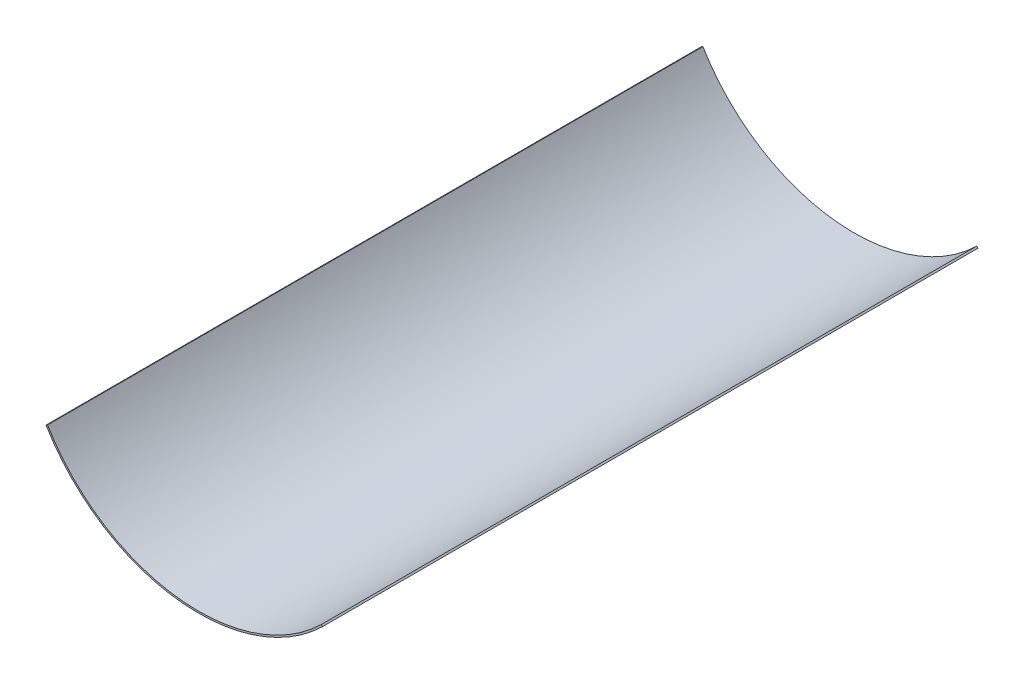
from build123d import *

# Parameters (mm, degrees)
BOSS_EXTRU_1_DEPTH = 745


with BuildPart() as part:
    # Esquisse1 → Boss.-Extru.1 (new body)
    with BuildSketch(Plane.XY):
        with BuildLine():
            Line((140.973235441, -144.673932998), (139.577460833, -143.24151782))
            ThreePointArc((139.577460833, -143.24151782), (-25.97114033, -198.306580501), (-171.756677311, -102.467769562))
            Line((-171.756677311, -102.467769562), (-173.474244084, -103.492447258))
            ThreePointArc((-173.474244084, -103.492447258), (-26.230851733, -200.289646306), (140.973235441, -144.673932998))
        make_face()
    extrude(amount=BOSS_EXTRU_1_DEPTH)


solid = part.part
